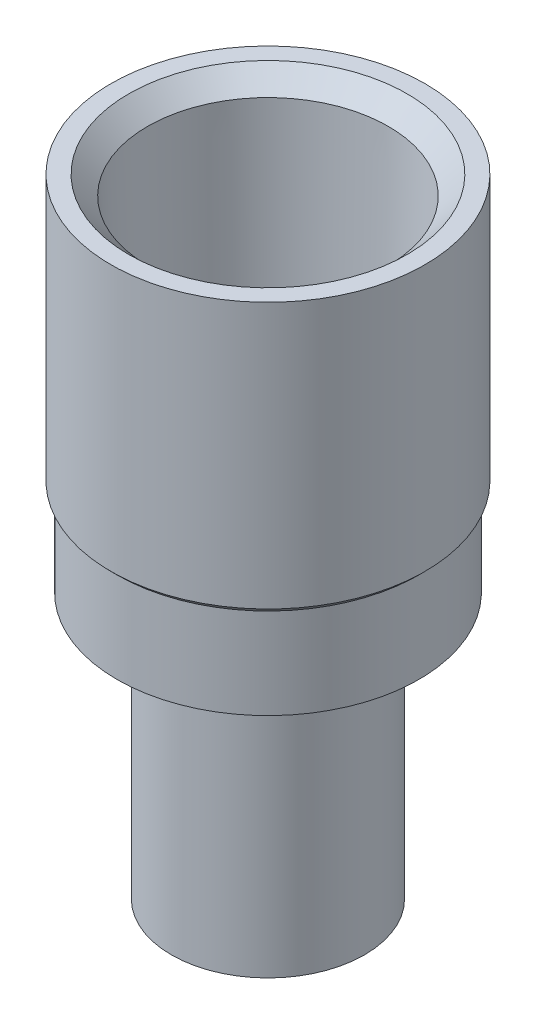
ISO-10303-21;
HEADER;
FILE_DESCRIPTION(('STEP AP214'),'2;1');
FILE_NAME('part.step','',(''),(''),'','','');
FILE_SCHEMA(('AUTOMOTIVE_DESIGN { 1 0 10303 214 1 1 1 1 }'));
ENDSEC;
DATA;
#1=APPLICATION_CONTEXT('core data for automotive mechanical design processes');
#2=APPLICATION_PROTOCOL_DEFINITION('international standard','automotive_design',2000,#1);
#3=PRODUCT_CONTEXT('',#1,'mechanical');
#4=PRODUCT('Part','Part','',(#3));
#5=PRODUCT_RELATED_PRODUCT_CATEGORY('part','',(#4));
#6=PRODUCT_DEFINITION_FORMATION('','',#4);
#7=PRODUCT_DEFINITION_CONTEXT('part definition',#1,'design');
#8=PRODUCT_DEFINITION('design','',#6,#7);
#9=PRODUCT_DEFINITION_SHAPE('','',#8);
#10=(LENGTH_UNIT() NAMED_UNIT(*) SI_UNIT(.MILLI.,.METRE.));
#11=(NAMED_UNIT(*) PLANE_ANGLE_UNIT() SI_UNIT($,.RADIAN.));
#12=(NAMED_UNIT(*) SI_UNIT($,.STERADIAN.) SOLID_ANGLE_UNIT());
#13=UNCERTAINTY_MEASURE_WITH_UNIT(LENGTH_MEASURE(1.E-05),#10,'distance_accuracy_value','');
#14=(GEOMETRIC_REPRESENTATION_CONTEXT(3) GLOBAL_UNCERTAINTY_ASSIGNED_CONTEXT((#13)) GLOBAL_UNIT_ASSIGNED_CONTEXT((#10,
#11,#12)) REPRESENTATION_CONTEXT('',''));
#15=CARTESIAN_POINT('',(0.,0.,0.));
#16=DIRECTION('',(0.,0.,1.));
#17=DIRECTION('',(1.,0.,0.));
#18=AXIS2_PLACEMENT_3D('',#15,#16,#17);
#19=CARTESIAN_POINT('',(0.,22.,0.));
#20=DIRECTION('',(0.,-1.,0.));
#21=DIRECTION('',(0.,0.,-1.));
#22=AXIS2_PLACEMENT_3D('',#19,#20,#21);
#23=PLANE('',#22);
#24=CARTESIAN_POINT('',(0.,22.,0.));
#25=DIRECTION('',(0.,-1.,0.));
#26=DIRECTION('',(0.,0.,-1.));
#27=AXIS2_PLACEMENT_3D('',#24,#25,#26);
#28=CIRCLE('',#27,10.);
#29=CARTESIAN_POINT('',(0.,22.,-10.));
#30=VERTEX_POINT('',#29);
#31=EDGE_CURVE('E45',#30,#30,#28,.F.);
#32=ORIENTED_EDGE('',*,*,#31,.T.);
#33=EDGE_LOOP('',(#32));
#34=FACE_BOUND('',#33,.T.);
#35=CARTESIAN_POINT('',(0.,22.,0.));
#36=DIRECTION('',(0.,-1.,0.));
#37=DIRECTION('',(0.,0.,-1.));
#38=AXIS2_PLACEMENT_3D('',#35,#36,#37);
#39=CIRCLE('',#38,12.5);
#40=CARTESIAN_POINT('',(0.,22.,-12.5));
#41=VERTEX_POINT('',#40);
#42=EDGE_CURVE('E55',#41,#41,#39,.T.);
#43=ORIENTED_EDGE('',*,*,#42,.T.);
#44=EDGE_LOOP('',(#43));
#45=FACE_BOUND('',#44,.T.);
#46=ADVANCED_FACE('F37',(#34,#45),#23,.T.);
#47=CARTESIAN_POINT('',(0.,22.,0.));
#48=DIRECTION('',(0.,-1.,0.));
#49=DIRECTION('',(0.,0.,-1.));
#50=AXIS2_PLACEMENT_3D('',#47,#48,#49);
#51=CYLINDRICAL_SURFACE('',#50,8.);
#52=CARTESIAN_POINT('',(0.,20.,0.));
#53=DIRECTION('',(0.,-1.,0.));
#54=DIRECTION('',(0.,0.,-1.));
#55=AXIS2_PLACEMENT_3D('',#52,#53,#54);
#56=CIRCLE('',#55,8.);
#57=CARTESIAN_POINT('',(0.,20.,-8.));
#58=VERTEX_POINT('',#57);
#59=EDGE_CURVE('E49',#58,#58,#56,.T.);
#60=ORIENTED_EDGE('',*,*,#59,.T.);
#61=EDGE_LOOP('',(#60));
#62=FACE_BOUND('',#61,.T.);
#63=CARTESIAN_POINT('',(0.,0.,0.));
#64=DIRECTION('',(0.,-1.,0.));
#65=DIRECTION('',(0.,0.,-1.));
#66=AXIS2_PLACEMENT_3D('',#63,#64,#65);
#67=CIRCLE('',#66,8.);
#68=CARTESIAN_POINT('',(0.,0.,-8.));
#69=VERTEX_POINT('',#68);
#70=EDGE_CURVE('E54',#69,#69,#67,.T.);
#71=ORIENTED_EDGE('',*,*,#70,.F.);
#72=EDGE_LOOP('',(#71));
#73=FACE_BOUND('',#72,.T.);
#74=ADVANCED_FACE('F102',(#62,#73),#51,.T.);
#75=CARTESIAN_POINT('',(0.,0.,0.));
#76=DIRECTION('',(0.,1.,0.));
#77=DIRECTION('',(0.,0.,1.));
#78=AXIS2_PLACEMENT_3D('',#75,#76,#77);
#79=PLANE('',#78);
#80=CARTESIAN_POINT('',(0.,0.,0.));
#81=DIRECTION('',(0.,-1.,0.));
#82=DIRECTION('',(0.,0.,-1.));
#83=AXIS2_PLACEMENT_3D('',#80,#81,#82);
#84=CIRCLE('',#83,3.);
#85=CARTESIAN_POINT('',(0.,0.,-3.));
#86=VERTEX_POINT('',#85);
#87=EDGE_CURVE('E81',#86,#86,#84,.T.);
#88=ORIENTED_EDGE('',*,*,#87,.F.);
#89=EDGE_LOOP('',(#88));
#90=FACE_BOUND('',#89,.T.);
#91=ORIENTED_EDGE('',*,*,#70,.T.);
#92=EDGE_LOOP('',(#91));
#93=FACE_BOUND('',#92,.T.);
#94=ADVANCED_FACE('F108',(#90,#93),#79,.F.);
#95=CARTESIAN_POINT('',(0.,20.,0.));
#96=DIRECTION('',(0.,1.,0.));
#97=DIRECTION('',(0.,0.,1.));
#98=AXIS2_PLACEMENT_3D('',#95,#96,#97);
#99=CONICAL_SURFACE('',#98,8.,0.785398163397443);
#100=ORIENTED_EDGE('',*,*,#31,.F.);
#101=EDGE_LOOP('',(#100));
#102=FACE_BOUND('',#101,.T.);
#103=ORIENTED_EDGE('',*,*,#59,.F.);
#104=EDGE_LOOP('',(#103));
#105=FACE_BOUND('',#104,.T.);
#106=ADVANCED_FACE('F122',(#102,#105),#99,.T.);
#107=CARTESIAN_POINT('',(0.,30.,0.));
#108=DIRECTION('',(0.,-1.,0.));
#109=DIRECTION('',(0.,0.,-1.));
#110=AXIS2_PLACEMENT_3D('',#107,#108,#109);
#111=CYLINDRICAL_SURFACE('',#110,12.5);
#112=CARTESIAN_POINT('',(0.,29.5,0.));
#113=DIRECTION('',(0.,-1.,0.));
#114=DIRECTION('',(0.,0.,-1.));
#115=AXIS2_PLACEMENT_3D('',#112,#113,#114);
#116=CIRCLE('',#115,12.5);
#117=CARTESIAN_POINT('',(0.,29.5,-12.5));
#118=VERTEX_POINT('',#117);
#119=EDGE_CURVE('E11',#118,#118,#116,.T.);
#120=ORIENTED_EDGE('',*,*,#119,.T.);
#121=EDGE_LOOP('',(#120));
#122=FACE_BOUND('',#121,.T.);
#123=ORIENTED_EDGE('',*,*,#42,.F.);
#124=EDGE_LOOP('',(#123));
#125=FACE_BOUND('',#124,.T.);
#126=ADVANCED_FACE('F118',(#122,#125),#111,.T.);
#127=CARTESIAN_POINT('',(0.,52.,0.));
#128=DIRECTION('',(0.,1.,0.));
#129=DIRECTION('',(0.,0.,1.));
#130=AXIS2_PLACEMENT_3D('',#127,#128,#129);
#131=PLANE('',#130);
#132=CARTESIAN_POINT('',(0.,52.,0.));
#133=DIRECTION('',(0.,1.,0.));
#134=DIRECTION('',(0.,0.,1.));
#135=AXIS2_PLACEMENT_3D('',#132,#133,#134);
#136=CIRCLE('',#135,11.5316);
#137=CARTESIAN_POINT('',(0.,52.,11.5316));
#138=VERTEX_POINT('',#137);
#139=EDGE_CURVE('E78',#138,#138,#136,.T.);
#140=ORIENTED_EDGE('',*,*,#139,.F.);
#141=EDGE_LOOP('',(#140));
#142=FACE_BOUND('',#141,.T.);
#143=CARTESIAN_POINT('',(0.,52.,0.));
#144=DIRECTION('',(0.,1.,0.));
#145=DIRECTION('',(0.,0.,1.));
#146=AXIS2_PLACEMENT_3D('',#143,#144,#145);
#147=CIRCLE('',#146,13.);
#148=CARTESIAN_POINT('',(0.,52.,-13.));
#149=VERTEX_POINT('',#148);
#150=EDGE_CURVE('E59',#149,#149,#147,.T.);
#151=ORIENTED_EDGE('',*,*,#150,.T.);
#152=EDGE_LOOP('',(#151));
#153=FACE_BOUND('',#152,.T.);
#154=ADVANCED_FACE('F114',(#142,#153),#131,.T.);
#155=CARTESIAN_POINT('',(0.,52.,0.));
#156=DIRECTION('',(0.,-1.,0.));
#157=DIRECTION('',(0.,0.,-1.));
#158=AXIS2_PLACEMENT_3D('',#155,#156,#157);
#159=CYLINDRICAL_SURFACE('',#158,13.);
#160=CARTESIAN_POINT('',(0.,30.,0.));
#161=DIRECTION('',(0.,-1.,0.));
#162=DIRECTION('',(0.,0.,-1.));
#163=AXIS2_PLACEMENT_3D('',#160,#161,#162);
#164=CIRCLE('',#163,13.);
#165=CARTESIAN_POINT('',(0.,30.,-13.));
#166=VERTEX_POINT('',#165);
#167=EDGE_CURVE('E52',#166,#166,#164,.T.);
#168=CARTESIAN_POINT('',(0.,52.,-13.));
#169=CARTESIAN_POINT('',(0.,51.7708333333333,-13.));
#170=CARTESIAN_POINT('',(0.,51.5416666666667,-13.));
#171=CARTESIAN_POINT('',(0.,51.0833333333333,-13.));
#172=CARTESIAN_POINT('',(0.,50.8541666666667,-13.));
#173=CARTESIAN_POINT('',(0.,50.3958333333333,-13.));
#174=CARTESIAN_POINT('',(0.,50.1666666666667,-13.));
#175=CARTESIAN_POINT('',(0.,49.7083333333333,-13.));
#176=CARTESIAN_POINT('',(0.,49.4791666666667,-13.));
#177=CARTESIAN_POINT('',(0.,49.0208333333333,-13.));
#178=CARTESIAN_POINT('',(0.,48.7916666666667,-13.));
#179=CARTESIAN_POINT('',(0.,48.3333333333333,-13.));
#180=CARTESIAN_POINT('',(0.,48.1041666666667,-13.));
#181=CARTESIAN_POINT('',(0.,47.6458333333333,-13.));
#182=CARTESIAN_POINT('',(0.,47.4166666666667,-13.));
#183=CARTESIAN_POINT('',(0.,46.9583333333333,-13.));
#184=CARTESIAN_POINT('',(0.,46.7291666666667,-13.));
#185=CARTESIAN_POINT('',(0.,46.2708333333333,-13.));
#186=CARTESIAN_POINT('',(0.,46.0416666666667,-13.));
#187=CARTESIAN_POINT('',(0.,45.5833333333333,-13.));
#188=CARTESIAN_POINT('',(0.,45.3541666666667,-13.));
#189=CARTESIAN_POINT('',(0.,44.8958333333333,-13.));
#190=CARTESIAN_POINT('',(0.,44.6666666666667,-13.));
#191=CARTESIAN_POINT('',(0.,44.2083333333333,-13.));
#192=CARTESIAN_POINT('',(0.,43.9791666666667,-13.));
#193=CARTESIAN_POINT('',(0.,43.5208333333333,-13.));
#194=CARTESIAN_POINT('',(0.,43.2916666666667,-13.));
#195=CARTESIAN_POINT('',(0.,42.8333333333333,-13.));
#196=CARTESIAN_POINT('',(0.,42.6041666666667,-13.));
#197=CARTESIAN_POINT('',(0.,42.1458333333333,-13.));
#198=CARTESIAN_POINT('',(0.,41.9166666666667,-13.));
#199=CARTESIAN_POINT('',(0.,41.4583333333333,-13.));
#200=CARTESIAN_POINT('',(0.,41.2291666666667,-13.));
#201=CARTESIAN_POINT('',(0.,40.7708333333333,-13.));
#202=CARTESIAN_POINT('',(0.,40.5416666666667,-13.));
#203=CARTESIAN_POINT('',(0.,40.0833333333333,-13.));
#204=CARTESIAN_POINT('',(0.,39.8541666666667,-13.));
#205=CARTESIAN_POINT('',(0.,39.3958333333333,-13.));
#206=CARTESIAN_POINT('',(0.,39.1666666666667,-13.));
#207=CARTESIAN_POINT('',(0.,38.7083333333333,-13.));
#208=CARTESIAN_POINT('',(0.,38.4791666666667,-13.));
#209=CARTESIAN_POINT('',(0.,38.0208333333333,-13.));
#210=CARTESIAN_POINT('',(0.,37.7916666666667,-13.));
#211=CARTESIAN_POINT('',(0.,37.3333333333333,-13.));
#212=CARTESIAN_POINT('',(0.,37.1041666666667,-13.));
#213=CARTESIAN_POINT('',(0.,36.6458333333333,-13.));
#214=CARTESIAN_POINT('',(0.,36.4166666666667,-13.));
#215=CARTESIAN_POINT('',(0.,35.9583333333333,-13.));
#216=CARTESIAN_POINT('',(0.,35.7291666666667,-13.));
#217=CARTESIAN_POINT('',(0.,35.2708333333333,-13.));
#218=CARTESIAN_POINT('',(0.,35.0416666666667,-13.));
#219=CARTESIAN_POINT('',(0.,34.5833333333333,-13.));
#220=CARTESIAN_POINT('',(0.,34.3541666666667,-13.));
#221=CARTESIAN_POINT('',(0.,33.8958333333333,-13.));
#222=CARTESIAN_POINT('',(0.,33.6666666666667,-13.));
#223=CARTESIAN_POINT('',(0.,33.2083333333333,-13.));
#224=CARTESIAN_POINT('',(0.,32.9791666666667,-13.));
#225=CARTESIAN_POINT('',(0.,32.5208333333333,-13.));
#226=CARTESIAN_POINT('',(0.,32.2916666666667,-13.));
#227=CARTESIAN_POINT('',(0.,31.8333333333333,-13.));
#228=CARTESIAN_POINT('',(0.,31.6041666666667,-13.));
#229=CARTESIAN_POINT('',(0.,31.1458333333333,-13.));
#230=CARTESIAN_POINT('',(0.,30.9166666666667,-13.));
#231=CARTESIAN_POINT('',(0.,30.4583333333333,-13.));
#232=CARTESIAN_POINT('',(0.,30.2291666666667,-13.));
#233=CARTESIAN_POINT('',(0.,30.,-13.));
#234=B_SPLINE_CURVE_WITH_KNOTS('',3,(#168,#169,#170,#171,#172,#173,#174,#175,#176,#177,#178,
#179,#180,#181,#182,#183,#184,#185,#186,#187,#188,#189,#190,#191,#192,#193,#194,#195,#196,#197,
#198,#199,#200,#201,#202,#203,#204,#205,#206,#207,#208,#209,#210,#211,#212,#213,#214,#215,#216,
#217,#218,#219,#220,#221,#222,#223,#224,#225,#226,#227,#228,#229,#230,#231,#232,#233),
.UNSPECIFIED.,.F.,.F.,(4,2,2,2,2,2,2,2,2,2,2,2,2,2,2,2,2,2,2,2,2,2,2,2,2,2,2,2,2,2,2,2,4),(0.,
0.687500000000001,1.375,2.0625,2.75,3.4375,4.125,4.8125,5.5,6.1875,6.875,7.5625,8.25,8.9375,
9.625,10.3125,11.,11.6875,12.375,13.0625,13.75,14.4375,15.125,15.8125,16.5,17.1875,17.875,
18.5625,19.25,19.9375,20.625,21.3125,22.),.UNSPECIFIED.);
#235=EDGE_CURVE('BSEAM117',#149,#166,#234,.T.);
#236=ORIENTED_EDGE('',*,*,#150,.F.);
#237=ORIENTED_EDGE('',*,*,#167,.F.);
#238=ORIENTED_EDGE('',*,*,#235,.T.);
#239=ORIENTED_EDGE('',*,*,#235,.F.);
#240=EDGE_LOOP('',(#236,#238,#237,#239));
#241=FACE_BOUND('',#240,.T.);
#242=ADVANCED_FACE('F117',(#241),#159,.T.);
#243=CARTESIAN_POINT('',(0.,29.5,0.));
#244=DIRECTION('',(0.,1.,0.));
#245=DIRECTION('',(0.,0.,1.));
#246=AXIS2_PLACEMENT_3D('',#243,#244,#245);
#247=CONICAL_SURFACE('',#246,12.5,0.785398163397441);
#248=ORIENTED_EDGE('',*,*,#167,.T.);
#249=EDGE_LOOP('',(#248));
#250=FACE_BOUND('',#249,.T.);
#251=ORIENTED_EDGE('',*,*,#119,.F.);
#252=EDGE_LOOP('',(#251));
#253=FACE_BOUND('',#252,.T.);
#254=ADVANCED_FACE('F39',(#250,#253),#247,.T.);
#255=CARTESIAN_POINT('',(0.,32.,0.));
#256=DIRECTION('',(0.,1.,0.));
#257=DIRECTION('',(0.,0.,1.));
#258=AXIS2_PLACEMENT_3D('',#255,#256,#257);
#259=CONICAL_SURFACE('',#258,8.9281,1.0471975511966);
#260=CARTESIAN_POINT('',(0.,28.577409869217,0.));
#261=DIRECTION('',(0.,1.,0.));
#262=DIRECTION('',(0.,0.,1.));
#263=AXIS2_PLACEMENT_3D('',#260,#261,#262);
#264=CIRCLE('',#263,3.);
#265=CARTESIAN_POINT('',(0.,28.577409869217,-3.));
#266=VERTEX_POINT('',#265);
#267=EDGE_CURVE('E41',#266,#266,#264,.F.);
#268=ORIENTED_EDGE('',*,*,#267,.T.);
#269=EDGE_LOOP('',(#268));
#270=FACE_BOUND('',#269,.T.);
#271=CARTESIAN_POINT('',(0.,32.,0.));
#272=DIRECTION('',(0.,1.,0.));
#273=DIRECTION('',(0.,0.,1.));
#274=AXIS2_PLACEMENT_3D('',#271,#272,#273);
#275=CIRCLE('',#274,8.9281);
#276=CARTESIAN_POINT('',(0.,32.,8.9281));
#277=VERTEX_POINT('',#276);
#278=EDGE_CURVE('E66',#277,#277,#275,.T.);
#279=ORIENTED_EDGE('',*,*,#278,.T.);
#280=EDGE_LOOP('',(#279));
#281=FACE_BOUND('',#280,.T.);
#282=ADVANCED_FACE('F88',(#270,#281),#259,.F.);
#283=CARTESIAN_POINT('',(0.,52.,0.));
#284=DIRECTION('',(0.,1.,0.));
#285=DIRECTION('',(0.,0.,1.));
#286=AXIS2_PLACEMENT_3D('',#283,#284,#285);
#287=CYLINDRICAL_SURFACE('',#286,8.9281);
#288=ORIENTED_EDGE('',*,*,#278,.F.);
#289=EDGE_LOOP('',(#288));
#290=FACE_BOUND('',#289,.T.);
#291=CARTESIAN_POINT('',(0.,35.5,0.));
#292=DIRECTION('',(0.,1.,0.));
#293=DIRECTION('',(0.,0.,1.));
#294=AXIS2_PLACEMENT_3D('',#291,#292,#293);
#295=CIRCLE('',#294,8.9281);
#296=CARTESIAN_POINT('',(0.,35.5,8.9281));
#297=VERTEX_POINT('',#296);
#298=EDGE_CURVE('E69',#297,#297,#295,.T.);
#299=ORIENTED_EDGE('',*,*,#298,.T.);
#300=EDGE_LOOP('',(#299));
#301=FACE_BOUND('',#300,.T.);
#302=ADVANCED_FACE('F143',(#290,#301),#287,.F.);
#303=CARTESIAN_POINT('',(8.9281,35.5,0.));
#304=DIRECTION('',(0.,-1.,0.));
#305=DIRECTION('',(0.,0.,-1.));
#306=AXIS2_PLACEMENT_3D('',#303,#304,#305);
#307=PLANE('',#306);
#308=ORIENTED_EDGE('',*,*,#298,.F.);
#309=EDGE_LOOP('',(#308));
#310=FACE_BOUND('',#309,.T.);
#311=CARTESIAN_POINT('',(0.,35.5,0.));
#312=DIRECTION('',(0.,1.,0.));
#313=DIRECTION('',(0.,0.,1.));
#314=AXIS2_PLACEMENT_3D('',#311,#312,#313);
#315=CIRCLE('',#314,9.52636638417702);
#316=CARTESIAN_POINT('',(0.,35.5,9.52636638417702));
#317=VERTEX_POINT('',#316);
#318=EDGE_CURVE('E72',#317,#317,#315,.T.);
#319=ORIENTED_EDGE('',*,*,#318,.T.);
#320=EDGE_LOOP('',(#319));
#321=FACE_BOUND('',#320,.T.);
#322=ADVANCED_FACE('F146',(#310,#321),#307,.F.);
#323=CARTESIAN_POINT('',(0.,50.4421545,0.));
#324=DIRECTION('',(0.,1.,0.));
#325=DIRECTION('',(0.,0.,1.));
#326=AXIS2_PLACEMENT_3D('',#323,#324,#325);
#327=CONICAL_SURFACE('',#326,9.9737545,0.029932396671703);
#328=ORIENTED_EDGE('',*,*,#318,.F.);
#329=EDGE_LOOP('',(#328));
#330=FACE_BOUND('',#329,.T.);
#331=CARTESIAN_POINT('',(0.,50.4421545,0.));
#332=DIRECTION('',(0.,1.,0.));
#333=DIRECTION('',(0.,0.,1.));
#334=AXIS2_PLACEMENT_3D('',#331,#332,#333);
#335=CIRCLE('',#334,9.9737545);
#336=CARTESIAN_POINT('',(0.,50.4421545,9.9737545));
#337=VERTEX_POINT('',#336);
#338=EDGE_CURVE('E75',#337,#337,#335,.T.);
#339=ORIENTED_EDGE('',*,*,#338,.T.);
#340=EDGE_LOOP('',(#339));
#341=FACE_BOUND('',#340,.T.);
#342=ADVANCED_FACE('F98',(#330,#341),#327,.F.);
#343=CARTESIAN_POINT('',(0.,52.,0.));
#344=DIRECTION('',(0.,1.,0.));
#345=DIRECTION('',(0.,0.,1.));
#346=AXIS2_PLACEMENT_3D('',#343,#344,#345);
#347=CONICAL_SURFACE('',#346,11.5316,0.78539816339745);
#348=ORIENTED_EDGE('',*,*,#338,.F.);
#349=EDGE_LOOP('',(#348));
#350=FACE_BOUND('',#349,.T.);
#351=ORIENTED_EDGE('',*,*,#139,.T.);
#352=EDGE_LOOP('',(#351));
#353=FACE_BOUND('',#352,.T.);
#354=ADVANCED_FACE('F93',(#350,#353),#347,.F.);
#355=CARTESIAN_POINT('',(0.,52.,0.));
#356=DIRECTION('',(0.,-1.,0.));
#357=DIRECTION('',(0.,0.,-1.));
#358=AXIS2_PLACEMENT_3D('',#355,#356,#357);
#359=CYLINDRICAL_SURFACE('',#358,3.);
#360=CARTESIAN_POINT('',(0.,0.,-3.));
#361=CARTESIAN_POINT('',(0.,0.297681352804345,-3.));
#362=CARTESIAN_POINT('',(0.,0.595362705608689,-3.));
#363=CARTESIAN_POINT('',(0.,1.19072541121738,-3.));
#364=CARTESIAN_POINT('',(0.,1.48840676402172,-3.));
#365=CARTESIAN_POINT('',(0.,2.0837694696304,-3.));
#366=CARTESIAN_POINT('',(0.,2.38145082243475,-3.));
#367=CARTESIAN_POINT('',(0.,2.97681352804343,-3.));
#368=CARTESIAN_POINT('',(0.,3.27449488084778,-3.));
#369=CARTESIAN_POINT('',(0.,3.86985758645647,-3.));
#370=CARTESIAN_POINT('',(0.,4.16753893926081,-3.));
#371=CARTESIAN_POINT('',(0.,4.7629016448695,-3.));
#372=CARTESIAN_POINT('',(0.,5.06058299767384,-3.));
#373=CARTESIAN_POINT('',(0.,5.65594570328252,-3.));
#374=CARTESIAN_POINT('',(0.,5.95362705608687,-3.));
#375=CARTESIAN_POINT('',(0.,6.54898976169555,-3.));
#376=CARTESIAN_POINT('',(0.,6.8466711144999,-3.));
#377=CARTESIAN_POINT('',(0.,7.44203382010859,-3.));
#378=CARTESIAN_POINT('',(0.,7.73971517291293,-3.));
#379=CARTESIAN_POINT('',(0.,8.33507787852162,-3.));
#380=CARTESIAN_POINT('',(0.,8.63275923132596,-3.));
#381=CARTESIAN_POINT('',(0.,9.22812193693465,-3.));
#382=CARTESIAN_POINT('',(0.,9.52580328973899,-3.));
#383=CARTESIAN_POINT('',(0.,10.1211659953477,-3.));
#384=CARTESIAN_POINT('',(0.,10.418847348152,-3.));
#385=CARTESIAN_POINT('',(0.,11.0142100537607,-3.));
#386=CARTESIAN_POINT('',(0.,11.3118914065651,-3.));
#387=CARTESIAN_POINT('',(0.,11.9072541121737,-3.));
#388=CARTESIAN_POINT('',(0.,12.2049354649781,-3.));
#389=CARTESIAN_POINT('',(0.,12.8002981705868,-3.));
#390=CARTESIAN_POINT('',(0.,13.0979795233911,-3.));
#391=CARTESIAN_POINT('',(0.,13.6933422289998,-3.));
#392=CARTESIAN_POINT('',(0.,13.9910235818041,-3.));
#393=CARTESIAN_POINT('',(0.,14.5863862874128,-3.));
#394=CARTESIAN_POINT('',(0.,14.8840676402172,-3.));
#395=CARTESIAN_POINT('',(0.,15.4794303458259,-3.));
#396=CARTESIAN_POINT('',(0.,15.7771116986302,-3.));
#397=CARTESIAN_POINT('',(0.,16.3724744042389,-3.));
#398=CARTESIAN_POINT('',(0.,16.6701557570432,-3.));
#399=CARTESIAN_POINT('',(0.,17.2655184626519,-3.));
#400=CARTESIAN_POINT('',(0.,17.5631998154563,-3.));
#401=CARTESIAN_POINT('',(0.,18.158562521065,-3.));
#402=CARTESIAN_POINT('',(0.,18.4562438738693,-3.));
#403=CARTESIAN_POINT('',(0.,19.051606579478,-3.));
#404=CARTESIAN_POINT('',(0.,19.3492879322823,-3.));
#405=CARTESIAN_POINT('',(0.,19.944650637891,-3.));
#406=CARTESIAN_POINT('',(0.,20.2423319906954,-3.));
#407=CARTESIAN_POINT('',(0.,20.837694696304,-3.));
#408=CARTESIAN_POINT('',(0.,21.1353760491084,-3.));
#409=CARTESIAN_POINT('',(0.,21.7307387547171,-3.));
#410=CARTESIAN_POINT('',(0.,22.0284201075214,-3.));
#411=CARTESIAN_POINT('',(0.,22.6237828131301,-3.));
#412=CARTESIAN_POINT('',(0.,22.9214641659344,-3.));
#413=CARTESIAN_POINT('',(0.,23.5168268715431,-3.));
#414=CARTESIAN_POINT('',(0.,23.8145082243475,-3.));
#415=CARTESIAN_POINT('',(0.,24.4098709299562,-3.));
#416=CARTESIAN_POINT('',(0.,24.7075522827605,-3.));
#417=CARTESIAN_POINT('',(0.,25.3029149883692,-3.));
#418=CARTESIAN_POINT('',(0.,25.6005963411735,-3.));
#419=CARTESIAN_POINT('',(0.,26.1959590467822,-3.));
#420=CARTESIAN_POINT('',(0.,26.4936403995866,-3.));
#421=CARTESIAN_POINT('',(0.,27.0890031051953,-3.));
#422=CARTESIAN_POINT('',(0.,27.3866844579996,-3.));
#423=CARTESIAN_POINT('',(0.,27.9820471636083,-3.));
#424=CARTESIAN_POINT('',(0.,28.2797285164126,-3.));
#425=CARTESIAN_POINT('',(0.,28.577409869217,-3.));
#426=B_SPLINE_CURVE_WITH_KNOTS('',3,(#360,#361,#362,#363,#364,#365,#366,#367,#368,#369,#370,
#371,#372,#373,#374,#375,#376,#377,#378,#379,#380,#381,#382,#383,#384,#385,#386,#387,#388,#389,
#390,#391,#392,#393,#394,#395,#396,#397,#398,#399,#400,#401,#402,#403,#404,#405,#406,#407,#408,
#409,#410,#411,#412,#413,#414,#415,#416,#417,#418,#419,#420,#421,#422,#423,#424,#425),
.UNSPECIFIED.,.F.,.F.,(4,2,2,2,2,2,2,2,2,2,2,2,2,2,2,2,2,2,2,2,2,2,2,2,2,2,2,2,2,2,2,2,4),(0.,
0.893044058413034,1.78608811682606,2.67913217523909,3.57217623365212,4.46522029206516,
5.35826435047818,6.25130840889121,7.14435246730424,8.03739652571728,8.9304405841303,
9.82348464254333,10.7165287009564,11.6095727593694,12.5026168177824,13.3956608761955,
14.2887049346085,15.1817489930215,16.0747930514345,16.9678371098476,17.8608811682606,
18.7539252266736,19.6469692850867,20.5400133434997,21.4330574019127,22.3261014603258,
23.2191455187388,24.1121895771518,25.0052336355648,25.8982776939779,26.7913217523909,
27.6843658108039,28.577409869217),.UNSPECIFIED.);
#427=EDGE_CURVE('BSEAM91',#86,#266,#426,.T.);
#428=ORIENTED_EDGE('',*,*,#87,.T.);
#429=ORIENTED_EDGE('',*,*,#267,.F.);
#430=ORIENTED_EDGE('',*,*,#427,.T.);
#431=ORIENTED_EDGE('',*,*,#427,.F.);
#432=EDGE_LOOP('',(#428,#430,#429,#431));
#433=FACE_BOUND('',#432,.T.);
#434=ADVANCED_FACE('F91',(#433),#359,.F.);
#435=CLOSED_SHELL('',(#46,#74,#94,#106,#126,#154,#242,#254,#282,#302,#322,#342,#354,#434));
#436=MANIFOLD_SOLID_BREP('B2',#435);
#437=ADVANCED_BREP_SHAPE_REPRESENTATION('',(#18,#436),#14);
#438=SHAPE_DEFINITION_REPRESENTATION(#9,#437);
ENDSEC;
END-ISO-10303-21;
